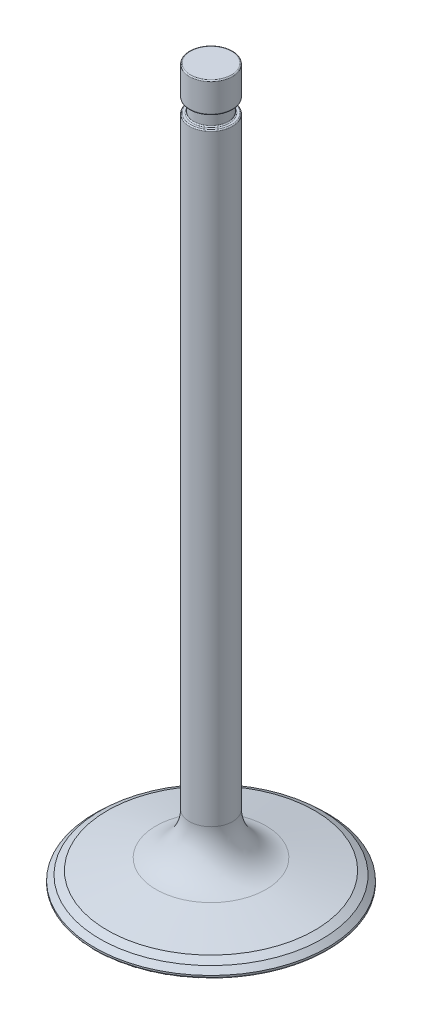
ISO-10303-21;
HEADER;
FILE_DESCRIPTION(('STEP AP214'),'2;1');
FILE_NAME('part.step','',(''),(''),'','','');
FILE_SCHEMA(('AUTOMOTIVE_DESIGN { 1 0 10303 214 1 1 1 1 }'));
ENDSEC;
DATA;
#1=APPLICATION_CONTEXT('core data for automotive mechanical design processes');
#2=APPLICATION_PROTOCOL_DEFINITION('international standard','automotive_design',2000,#1);
#3=PRODUCT_CONTEXT('',#1,'mechanical');
#4=PRODUCT('Part','Part','',(#3));
#5=PRODUCT_RELATED_PRODUCT_CATEGORY('part','',(#4));
#6=PRODUCT_DEFINITION_FORMATION('','',#4);
#7=PRODUCT_DEFINITION_CONTEXT('part definition',#1,'design');
#8=PRODUCT_DEFINITION('design','',#6,#7);
#9=PRODUCT_DEFINITION_SHAPE('','',#8);
#10=(LENGTH_UNIT() NAMED_UNIT(*) SI_UNIT(.MILLI.,.METRE.));
#11=(NAMED_UNIT(*) PLANE_ANGLE_UNIT() SI_UNIT($,.RADIAN.));
#12=(NAMED_UNIT(*) SI_UNIT($,.STERADIAN.) SOLID_ANGLE_UNIT());
#13=UNCERTAINTY_MEASURE_WITH_UNIT(LENGTH_MEASURE(1.E-05),#10,'distance_accuracy_value','');
#14=(GEOMETRIC_REPRESENTATION_CONTEXT(3) GLOBAL_UNCERTAINTY_ASSIGNED_CONTEXT((#13)) GLOBAL_UNIT_ASSIGNED_CONTEXT((#10,
#11,#12)) REPRESENTATION_CONTEXT('',''));
#15=CARTESIAN_POINT('',(0.,0.,0.));
#16=DIRECTION('',(0.,0.,1.));
#17=DIRECTION('',(1.,0.,0.));
#18=AXIS2_PLACEMENT_3D('',#15,#16,#17);
#19=CARTESIAN_POINT('',(0.,0.,0.));
#20=DIRECTION('',(0.,1.,0.));
#21=DIRECTION('',(0.,0.,1.));
#22=AXIS2_PLACEMENT_3D('',#19,#20,#21);
#23=PLANE('',#22);
#24=CARTESIAN_POINT('',(0.,0.,0.));
#25=DIRECTION('',(0.,1.,0.));
#26=DIRECTION('',(0.,0.,1.));
#27=AXIS2_PLACEMENT_3D('',#24,#25,#26);
#28=CIRCLE('',#27,26.75);
#29=CARTESIAN_POINT('',(0.,0.,26.75));
#30=VERTEX_POINT('',#29);
#31=EDGE_CURVE('E44',#30,#30,#28,.F.);
#32=ORIENTED_EDGE('',*,*,#31,.T.);
#33=EDGE_LOOP('',(#32));
#34=FACE_BOUND('',#33,.T.);
#35=ADVANCED_FACE('F33',(#34),#23,.F.);
#36=CARTESIAN_POINT('',(0.,0.,0.));
#37=DIRECTION('',(0.,-1.,0.));
#38=DIRECTION('',(0.,0.,-1.));
#39=AXIS2_PLACEMENT_3D('',#36,#37,#38);
#40=CYLINDRICAL_SURFACE('',#39,27.);
#41=CARTESIAN_POINT('',(0.,0.249999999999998,0.));
#42=DIRECTION('',(0.,1.,0.));
#43=DIRECTION('',(0.,0.,1.));
#44=AXIS2_PLACEMENT_3D('',#41,#42,#43);
#45=CIRCLE('',#44,27.);
#46=CARTESIAN_POINT('',(0.,0.249999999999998,27.));
#47=VERTEX_POINT('',#46);
#48=EDGE_CURVE('E40',#47,#47,#45,.T.);
#49=ORIENTED_EDGE('',*,*,#48,.T.);
#50=EDGE_LOOP('',(#49));
#51=FACE_BOUND('',#50,.T.);
#52=CARTESIAN_POINT('',(0.,0.637006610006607,0.));
#53=DIRECTION('',(0.,-1.,0.));
#54=DIRECTION('',(0.,0.,-1.));
#55=AXIS2_PLACEMENT_3D('',#52,#53,#54);
#56=CIRCLE('',#55,27.);
#57=CARTESIAN_POINT('',(0.,0.637006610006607,-27.));
#58=VERTEX_POINT('',#57);
#59=EDGE_CURVE('E83',#58,#58,#56,.T.);
#60=ORIENTED_EDGE('',*,*,#59,.T.);
#61=EDGE_LOOP('',(#60));
#62=FACE_BOUND('',#61,.T.);
#63=ADVANCED_FACE('F114',(#51,#62),#40,.T.);
#64=CARTESIAN_POINT('',(0.,7.,0.));
#65=DIRECTION('',(0.,-1.,0.));
#66=DIRECTION('',(0.,0.,-1.));
#67=AXIS2_PLACEMENT_3D('',#64,#65,#66);
#68=CONICAL_SURFACE('',#67,5.,1.34731972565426);
#69=CARTESIAN_POINT('',(0.,2.6648633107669,0.));
#70=DIRECTION('',(0.,-1.,0.));
#71=DIRECTION('',(0.,0.,-1.));
#72=AXIS2_PLACEMENT_3D('',#69,#70,#71);
#73=CIRCLE('',#72,24.0746014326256);
#74=CARTESIAN_POINT('',(0.,2.6648633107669,-24.0746014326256));
#75=VERTEX_POINT('',#74);
#76=EDGE_CURVE('E80',#75,#75,#73,.F.);
#77=ORIENTED_EDGE('',*,*,#76,.T.);
#78=EDGE_LOOP('',(#77));
#79=FACE_BOUND('',#78,.T.);
#80=CARTESIAN_POINT('',(0.,5.23095705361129,0.));
#81=DIRECTION('',(0.,-1.,0.));
#82=DIRECTION('',(0.,0.,-1.));
#83=AXIS2_PLACEMENT_3D('',#80,#81,#82);
#84=CIRCLE('',#83,12.7837889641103);
#85=CARTESIAN_POINT('',(0.,5.23095705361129,-12.7837889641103));
#86=VERTEX_POINT('',#85);
#87=EDGE_CURVE('E89',#86,#86,#84,.T.);
#88=ORIENTED_EDGE('',*,*,#87,.T.);
#89=EDGE_LOOP('',(#88));
#90=FACE_BOUND('',#89,.T.);
#91=ADVANCED_FACE('F93',(#79,#90),#68,.T.);
#92=CARTESIAN_POINT('',(0.,0.,0.));
#93=DIRECTION('',(0.,-1.,0.));
#94=DIRECTION('',(0.,0.,-1.));
#95=AXIS2_PLACEMENT_3D('',#92,#93,#94);
#96=CYLINDRICAL_SURFACE('',#95,5.);
#97=CARTESIAN_POINT('',(0.,154.75,0.));
#98=DIRECTION('',(0.,-1.,0.));
#99=DIRECTION('',(0.,0.,-1.));
#100=AXIS2_PLACEMENT_3D('',#97,#98,#99);
#101=CIRCLE('',#100,5.);
#102=CARTESIAN_POINT('',(0.,154.75,-5.));
#103=VERTEX_POINT('',#102);
#104=EDGE_CURVE('E10',#103,#103,#101,.T.);
#105=ORIENTED_EDGE('',*,*,#104,.T.);
#106=EDGE_LOOP('',(#105));
#107=FACE_BOUND('',#106,.T.);
#108=CARTESIAN_POINT('',(0.,14.9822856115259,0.));
#109=DIRECTION('',(0.,-1.,0.));
#110=DIRECTION('',(0.,0.,-1.));
#111=AXIS2_PLACEMENT_3D('',#108,#109,#110);
#112=CIRCLE('',#111,5.);
#113=CARTESIAN_POINT('',(0.,14.9822856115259,-5.));
#114=VERTEX_POINT('',#113);
#115=EDGE_CURVE('E86',#114,#114,#112,.F.);
#116=ORIENTED_EDGE('',*,*,#115,.T.);
#117=EDGE_LOOP('',(#116));
#118=FACE_BOUND('',#117,.T.);
#119=ADVANCED_FACE('F123',(#107,#118),#96,.T.);
#120=CARTESIAN_POINT('',(-4.,155.,0.));
#121=DIRECTION('',(0.,-1.,0.));
#122=DIRECTION('',(0.,0.,-1.));
#123=AXIS2_PLACEMENT_3D('',#120,#121,#122);
#124=PLANE('',#123);
#125=CARTESIAN_POINT('',(0.,155.,0.));
#126=DIRECTION('',(0.,-1.,0.));
#127=DIRECTION('',(0.,0.,-1.));
#128=AXIS2_PLACEMENT_3D('',#125,#126,#127);
#129=CIRCLE('',#128,4.25);
#130=CARTESIAN_POINT('',(0.,155.,-4.25));
#131=VERTEX_POINT('',#130);
#132=EDGE_CURVE('E59',#131,#131,#129,.T.);
#133=ORIENTED_EDGE('',*,*,#132,.T.);
#134=EDGE_LOOP('',(#133));
#135=FACE_BOUND('',#134,.T.);
#136=CARTESIAN_POINT('',(0.,155.,0.));
#137=DIRECTION('',(0.,-1.,0.));
#138=DIRECTION('',(0.,0.,-1.));
#139=AXIS2_PLACEMENT_3D('',#136,#137,#138);
#140=CIRCLE('',#139,4.75);
#141=CARTESIAN_POINT('',(0.,155.,-4.75));
#142=VERTEX_POINT('',#141);
#143=EDGE_CURVE('E62',#142,#142,#140,.F.);
#144=ORIENTED_EDGE('',*,*,#143,.T.);
#145=EDGE_LOOP('',(#144));
#146=FACE_BOUND('',#145,.T.);
#147=ADVANCED_FACE('F127',(#135,#146),#124,.F.);
#148=CARTESIAN_POINT('',(0.,0.,0.));
#149=DIRECTION('',(0.,-1.,0.));
#150=DIRECTION('',(0.,0.,-1.));
#151=AXIS2_PLACEMENT_3D('',#148,#149,#150);
#152=CYLINDRICAL_SURFACE('',#151,4.);
#153=CARTESIAN_POINT('',(0.,157.75,0.));
#154=DIRECTION('',(0.,1.,0.));
#155=DIRECTION('',(0.,0.,1.));
#156=AXIS2_PLACEMENT_3D('',#153,#154,#155);
#157=CIRCLE('',#156,4.);
#158=CARTESIAN_POINT('',(0.,157.75,4.));
#159=VERTEX_POINT('',#158);
#160=EDGE_CURVE('E71',#159,#159,#157,.F.);
#161=ORIENTED_EDGE('',*,*,#160,.T.);
#162=EDGE_LOOP('',(#161));
#163=FACE_BOUND('',#162,.T.);
#164=CARTESIAN_POINT('',(0.,155.25,0.));
#165=DIRECTION('',(0.,-1.,0.));
#166=DIRECTION('',(0.,0.,-1.));
#167=AXIS2_PLACEMENT_3D('',#164,#165,#166);
#168=CIRCLE('',#167,4.);
#169=CARTESIAN_POINT('',(0.,155.25,-4.));
#170=VERTEX_POINT('',#169);
#171=EDGE_CURVE('E74',#170,#170,#168,.F.);
#172=ORIENTED_EDGE('',*,*,#171,.T.);
#173=EDGE_LOOP('',(#172));
#174=FACE_BOUND('',#173,.T.);
#175=ADVANCED_FACE('F130',(#163,#174),#152,.T.);
#176=CARTESIAN_POINT('',(-5.,158.,0.));
#177=DIRECTION('',(0.,1.,0.));
#178=DIRECTION('',(0.,0.,1.));
#179=AXIS2_PLACEMENT_3D('',#176,#177,#178);
#180=PLANE('',#179);
#181=CARTESIAN_POINT('',(0.,158.,0.));
#182=DIRECTION('',(0.,1.,0.));
#183=DIRECTION('',(0.,0.,1.));
#184=AXIS2_PLACEMENT_3D('',#181,#182,#183);
#185=CIRCLE('',#184,4.25);
#186=CARTESIAN_POINT('',(0.,158.,4.25));
#187=VERTEX_POINT('',#186);
#188=EDGE_CURVE('E65',#187,#187,#185,.T.);
#189=ORIENTED_EDGE('',*,*,#188,.T.);
#190=EDGE_LOOP('',(#189));
#191=FACE_BOUND('',#190,.T.);
#192=CARTESIAN_POINT('',(0.,158.,0.));
#193=DIRECTION('',(0.,1.,0.));
#194=DIRECTION('',(0.,0.,1.));
#195=AXIS2_PLACEMENT_3D('',#192,#193,#194);
#196=CIRCLE('',#195,4.75);
#197=CARTESIAN_POINT('',(0.,158.,4.75));
#198=VERTEX_POINT('',#197);
#199=EDGE_CURVE('E68',#198,#198,#196,.F.);
#200=ORIENTED_EDGE('',*,*,#199,.T.);
#201=EDGE_LOOP('',(#200));
#202=FACE_BOUND('',#201,.T.);
#203=ADVANCED_FACE('F134',(#191,#202),#180,.F.);
#204=CARTESIAN_POINT('',(0.,0.,0.));
#205=DIRECTION('',(0.,-1.,0.));
#206=DIRECTION('',(0.,0.,-1.));
#207=AXIS2_PLACEMENT_3D('',#204,#205,#206);
#208=CYLINDRICAL_SURFACE('',#207,5.);
#209=CARTESIAN_POINT('',(0.,164.75,0.));
#210=DIRECTION('',(0.,-1.,0.));
#211=DIRECTION('',(0.,0.,-1.));
#212=AXIS2_PLACEMENT_3D('',#209,#210,#211);
#213=CIRCLE('',#212,5.);
#214=CARTESIAN_POINT('',(0.,164.75,-5.));
#215=VERTEX_POINT('',#214);
#216=EDGE_CURVE('E53',#215,#215,#213,.T.);
#217=ORIENTED_EDGE('',*,*,#216,.T.);
#218=EDGE_LOOP('',(#217));
#219=FACE_BOUND('',#218,.T.);
#220=CARTESIAN_POINT('',(0.,158.25,0.));
#221=DIRECTION('',(0.,1.,0.));
#222=DIRECTION('',(0.,0.,1.));
#223=AXIS2_PLACEMENT_3D('',#220,#221,#222);
#224=CIRCLE('',#223,5.);
#225=CARTESIAN_POINT('',(0.,158.25,5.));
#226=VERTEX_POINT('',#225);
#227=EDGE_CURVE('E56',#226,#226,#224,.T.);
#228=ORIENTED_EDGE('',*,*,#227,.T.);
#229=EDGE_LOOP('',(#228));
#230=FACE_BOUND('',#229,.T.);
#231=ADVANCED_FACE('F108',(#219,#230),#208,.T.);
#232=CARTESIAN_POINT('',(-5.,165.,0.));
#233=DIRECTION('',(0.,-1.,0.));
#234=DIRECTION('',(0.,0.,-1.));
#235=AXIS2_PLACEMENT_3D('',#232,#233,#234);
#236=PLANE('',#235);
#237=CARTESIAN_POINT('',(0.,165.,0.));
#238=DIRECTION('',(0.,-1.,0.));
#239=DIRECTION('',(0.,0.,-1.));
#240=AXIS2_PLACEMENT_3D('',#237,#238,#239);
#241=CIRCLE('',#240,4.75);
#242=CARTESIAN_POINT('',(0.,165.,-4.75));
#243=VERTEX_POINT('',#242);
#244=EDGE_CURVE('E48',#243,#243,#241,.F.);
#245=ORIENTED_EDGE('',*,*,#244,.T.);
#246=EDGE_LOOP('',(#245));
#247=FACE_BOUND('',#246,.T.);
#248=ADVANCED_FACE('F98',(#247),#236,.F.);
#249=CARTESIAN_POINT('',(0.,14.9822856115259,0.));
#250=DIRECTION('',(0.,-1.,0.));
#251=DIRECTION('',(0.,0.,-1.));
#252=AXIS2_PLACEMENT_3D('',#249,#250,#251);
#253=TOROIDAL_SURFACE('',#252,15.,10.);
#254=ORIENTED_EDGE('',*,*,#115,.F.);
#255=EDGE_LOOP('',(#254));
#256=FACE_BOUND('',#255,.T.);
#257=ORIENTED_EDGE('',*,*,#87,.F.);
#258=EDGE_LOOP('',(#257));
#259=FACE_BOUND('',#258,.T.);
#260=ADVANCED_FACE('F95',(#256,#259),#253,.F.);
#261=CARTESIAN_POINT('',(0.,0.637006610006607,0.));
#262=DIRECTION('',(0.,-1.,0.));
#263=DIRECTION('',(0.,0.,-1.));
#264=AXIS2_PLACEMENT_3D('',#261,#262,#263);
#265=CONICAL_SURFACE('',#264,27.,0.823720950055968);
#266=CARTESIAN_POINT('',(0.,1.76374627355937,0.));
#267=DIRECTION('',(0.,-1.,0.));
#268=DIRECTION('',(0.,0.,-1.));
#269=AXIS2_PLACEMENT_3D('',#266,#267,#268);
#270=CIRCLE('',#269,25.7834135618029);
#271=CARTESIAN_POINT('',(0.,1.76374627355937,-25.7834135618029));
#272=VERTEX_POINT('',#271);
#273=EDGE_CURVE('E77',#272,#272,#270,.T.);
#274=ORIENTED_EDGE('',*,*,#273,.T.);
#275=EDGE_LOOP('',(#274));
#276=FACE_BOUND('',#275,.T.);
#277=ORIENTED_EDGE('',*,*,#59,.F.);
#278=EDGE_LOOP('',(#277));
#279=FACE_BOUND('',#278,.T.);
#280=ADVANCED_FACE('F97',(#276,#279),#265,.T.);
#281=CARTESIAN_POINT('',(0.,2.66486331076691,0.));
#282=DIRECTION('',(0.,-1.,0.));
#283=DIRECTION('',(0.,0.,-1.));
#284=AXIS2_PLACEMENT_3D('',#281,#282,#283);
#285=CONICAL_SURFACE('',#284,24.0746014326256,1.08552033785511);
#286=CARTESIAN_POINT('',(0.,1.76374627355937,-25.7834135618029));
#287=CARTESIAN_POINT('',(0.,1.77313290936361,-25.7656134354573));
#288=CARTESIAN_POINT('',(0.,1.78251954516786,-25.7478133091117));
#289=CARTESIAN_POINT('',(0.,1.80129281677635,-25.7122130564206));
#290=CARTESIAN_POINT('',(0.,1.81067945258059,-25.694412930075));
#291=CARTESIAN_POINT('',(0.,1.82945272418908,-25.6588126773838));
#292=CARTESIAN_POINT('',(0.,1.83883935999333,-25.6410125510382));
#293=CARTESIAN_POINT('',(0.,1.85761263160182,-25.605412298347));
#294=CARTESIAN_POINT('',(0.,1.86699926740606,-25.5876121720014));
#295=CARTESIAN_POINT('',(0.,1.88577253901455,-25.5520119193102));
#296=CARTESIAN_POINT('',(0.,1.8951591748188,-25.5342117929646));
#297=CARTESIAN_POINT('',(0.,1.91393244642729,-25.4986115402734));
#298=CARTESIAN_POINT('',(0.,1.92331908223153,-25.4808114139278));
#299=CARTESIAN_POINT('',(0.,1.94209235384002,-25.4452111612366));
#300=CARTESIAN_POINT('',(0.,1.95147898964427,-25.427411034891));
#301=CARTESIAN_POINT('',(0.,1.97025226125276,-25.3918107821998));
#302=CARTESIAN_POINT('',(0.,1.97963889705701,-25.3740106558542));
#303=CARTESIAN_POINT('',(0.,1.9984121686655,-25.338410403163));
#304=CARTESIAN_POINT('',(0.,2.00779880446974,-25.3206102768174));
#305=CARTESIAN_POINT('',(0.,2.02657207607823,-25.2850100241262));
#306=CARTESIAN_POINT('',(0.,2.03595871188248,-25.2672098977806));
#307=CARTESIAN_POINT('',(0.,2.05473198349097,-25.2316096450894));
#308=CARTESIAN_POINT('',(0.,2.06411861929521,-25.2138095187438));
#309=CARTESIAN_POINT('',(0.,2.0828918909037,-25.1782092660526));
#310=CARTESIAN_POINT('',(0.,2.09227852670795,-25.160409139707));
#311=CARTESIAN_POINT('',(0.,2.11105179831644,-25.1248088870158));
#312=CARTESIAN_POINT('',(0.,2.12043843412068,-25.1070087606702));
#313=CARTESIAN_POINT('',(0.,2.13921170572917,-25.071408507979));
#314=CARTESIAN_POINT('',(0.,2.14859834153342,-25.0536083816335));
#315=CARTESIAN_POINT('',(0.,2.16737161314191,-25.0180081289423));
#316=CARTESIAN_POINT('',(0.,2.17675824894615,-25.0002080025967));
#317=CARTESIAN_POINT('',(0.,2.19553152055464,-24.9646077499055));
#318=CARTESIAN_POINT('',(0.,2.20491815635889,-24.9468076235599));
#319=CARTESIAN_POINT('',(0.,2.22369142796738,-24.9112073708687));
#320=CARTESIAN_POINT('',(0.,2.23307806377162,-24.8934072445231));
#321=CARTESIAN_POINT('',(0.,2.25185133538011,-24.8578069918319));
#322=CARTESIAN_POINT('',(0.,2.26123797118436,-24.8400068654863));
#323=CARTESIAN_POINT('',(0.,2.28001124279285,-24.8044066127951));
#324=CARTESIAN_POINT('',(0.,2.2893978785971,-24.7866064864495));
#325=CARTESIAN_POINT('',(0.,2.30817115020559,-24.7510062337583));
#326=CARTESIAN_POINT('',(0.,2.31755778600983,-24.7332061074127));
#327=CARTESIAN_POINT('',(0.,2.33633105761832,-24.6976058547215));
#328=CARTESIAN_POINT('',(0.,2.34571769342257,-24.6798057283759));
#329=CARTESIAN_POINT('',(0.,2.36449096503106,-24.6442054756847));
#330=CARTESIAN_POINT('',(0.,2.3738776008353,-24.6264053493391));
#331=CARTESIAN_POINT('',(0.,2.39265087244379,-24.5908050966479));
#332=CARTESIAN_POINT('',(0.,2.40203750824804,-24.5730049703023));
#333=CARTESIAN_POINT('',(0.,2.42081077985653,-24.5374047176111));
#334=CARTESIAN_POINT('',(0.,2.43019741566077,-24.5196045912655));
#335=CARTESIAN_POINT('',(0.,2.44897068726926,-24.4840043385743));
#336=CARTESIAN_POINT('',(0.,2.45835732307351,-24.4662042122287));
#337=CARTESIAN_POINT('',(0.,2.477130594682,-24.4306039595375));
#338=CARTESIAN_POINT('',(0.,2.48651723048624,-24.412803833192));
#339=CARTESIAN_POINT('',(0.,2.50529050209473,-24.3772035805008));
#340=CARTESIAN_POINT('',(0.,2.51467713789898,-24.3594034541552));
#341=CARTESIAN_POINT('',(0.,2.53345040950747,-24.323803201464));
#342=CARTESIAN_POINT('',(0.,2.54283704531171,-24.3060030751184));
#343=CARTESIAN_POINT('',(0.,2.56161031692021,-24.2704028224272));
#344=CARTESIAN_POINT('',(0.,2.57099695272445,-24.2526026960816));
#345=CARTESIAN_POINT('',(0.,2.58977022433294,-24.2170024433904));
#346=CARTESIAN_POINT('',(0.,2.59915686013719,-24.1992023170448));
#347=CARTESIAN_POINT('',(0.,2.61793013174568,-24.1636020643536));
#348=CARTESIAN_POINT('',(0.,2.62731676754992,-24.145801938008));
#349=CARTESIAN_POINT('',(0.,2.64609003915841,-24.1102016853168));
#350=CARTESIAN_POINT('',(0.,2.65547667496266,-24.0924015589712));
#351=CARTESIAN_POINT('',(0.,2.6648633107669,-24.0746014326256));
#352=B_SPLINE_CURVE_WITH_KNOTS('',3,(#286,#287,#288,#289,#290,#291,#292,#293,#294,#295,#296,
#297,#298,#299,#300,#301,#302,#303,#304,#305,#306,#307,#308,#309,#310,#311,#312,#313,#314,#315,
#316,#317,#318,#319,#320,#321,#322,#323,#324,#325,#326,#327,#328,#329,#330,#331,#332,#333,#334,
#335,#336,#337,#338,#339,#340,#341,#342,#343,#344,#345,#346,#347,#348,#349,#350,#351),
.UNSPECIFIED.,.F.,.F.,(4,2,2,2,2,2,2,2,2,2,2,2,2,2,2,2,2,2,2,2,2,2,2,2,2,2,2,2,2,2,2,2,4),(0.,
0.0603703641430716,0.12074072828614,0.181111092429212,0.24148145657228,0.301851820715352,
0.36222218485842,0.422592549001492,0.48296291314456,0.543333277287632,0.6037036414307,
0.664074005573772,0.72444436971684,0.784814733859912,0.845185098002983,0.905555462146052,
0.965925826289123,1.02629619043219,1.08666655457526,1.14703691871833,1.2074072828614,
1.26777764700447,1.32814801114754,1.38851837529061,1.44888873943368,1.50925910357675,
1.56962946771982,1.62999983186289,1.69037019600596,1.75074056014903,1.8111109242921,
1.87148128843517,1.93185165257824),.UNSPECIFIED.);
#353=EDGE_CURVE('BSEAM105',#272,#75,#352,.T.);
#354=ORIENTED_EDGE('',*,*,#273,.F.);
#355=ORIENTED_EDGE('',*,*,#76,.F.);
#356=ORIENTED_EDGE('',*,*,#353,.T.);
#357=ORIENTED_EDGE('',*,*,#353,.F.);
#358=EDGE_LOOP('',(#354,#356,#355,#357));
#359=FACE_BOUND('',#358,.T.);
#360=ADVANCED_FACE('F105',(#359),#285,.T.);
#361=CARTESIAN_POINT('',(0.,157.75,0.));
#362=DIRECTION('',(0.,1.,0.));
#363=DIRECTION('',(0.,0.,1.));
#364=AXIS2_PLACEMENT_3D('',#361,#362,#363);
#365=TOROIDAL_SURFACE('',#364,4.25,0.25);
#366=ORIENTED_EDGE('',*,*,#188,.F.);
#367=EDGE_LOOP('',(#366));
#368=FACE_BOUND('',#367,.T.);
#369=ORIENTED_EDGE('',*,*,#160,.F.);
#370=EDGE_LOOP('',(#369));
#371=FACE_BOUND('',#370,.T.);
#372=ADVANCED_FACE('F166',(#368,#371),#365,.F.);
#373=CARTESIAN_POINT('',(0.,155.25,0.));
#374=DIRECTION('',(0.,-1.,0.));
#375=DIRECTION('',(0.,0.,-1.));
#376=AXIS2_PLACEMENT_3D('',#373,#374,#375);
#377=TOROIDAL_SURFACE('',#376,4.25,0.25);
#378=ORIENTED_EDGE('',*,*,#171,.F.);
#379=EDGE_LOOP('',(#378));
#380=FACE_BOUND('',#379,.T.);
#381=ORIENTED_EDGE('',*,*,#132,.F.);
#382=EDGE_LOOP('',(#381));
#383=FACE_BOUND('',#382,.T.);
#384=ADVANCED_FACE('F160',(#380,#383),#377,.F.);
#385=CARTESIAN_POINT('',(0.,164.75,0.));
#386=DIRECTION('',(0.,-1.,0.));
#387=DIRECTION('',(0.,0.,-1.));
#388=AXIS2_PLACEMENT_3D('',#385,#386,#387);
#389=TOROIDAL_SURFACE('',#388,4.75,0.25);
#390=ORIENTED_EDGE('',*,*,#244,.F.);
#391=EDGE_LOOP('',(#390));
#392=FACE_BOUND('',#391,.T.);
#393=ORIENTED_EDGE('',*,*,#216,.F.);
#394=EDGE_LOOP('',(#393));
#395=FACE_BOUND('',#394,.T.);
#396=ADVANCED_FACE('F151',(#392,#395),#389,.T.);
#397=CARTESIAN_POINT('',(0.,158.25,0.));
#398=DIRECTION('',(0.,1.,0.));
#399=DIRECTION('',(0.,0.,1.));
#400=AXIS2_PLACEMENT_3D('',#397,#398,#399);
#401=TOROIDAL_SURFACE('',#400,4.75,0.25);
#402=ORIENTED_EDGE('',*,*,#227,.F.);
#403=EDGE_LOOP('',(#402));
#404=FACE_BOUND('',#403,.T.);
#405=ORIENTED_EDGE('',*,*,#199,.F.);
#406=EDGE_LOOP('',(#405));
#407=FACE_BOUND('',#406,.T.);
#408=ADVANCED_FACE('F147',(#404,#407),#401,.T.);
#409=CARTESIAN_POINT('',(0.,0.249999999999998,0.));
#410=DIRECTION('',(0.,1.,0.));
#411=DIRECTION('',(0.,0.,1.));
#412=AXIS2_PLACEMENT_3D('',#409,#410,#411);
#413=TOROIDAL_SURFACE('',#412,26.75,0.25);
#414=ORIENTED_EDGE('',*,*,#48,.F.);
#415=EDGE_LOOP('',(#414));
#416=FACE_BOUND('',#415,.T.);
#417=ORIENTED_EDGE('',*,*,#31,.F.);
#418=EDGE_LOOP('',(#417));
#419=FACE_BOUND('',#418,.T.);
#420=ADVANCED_FACE('F150',(#416,#419),#413,.T.);
#421=CARTESIAN_POINT('',(0.,154.75,0.));
#422=DIRECTION('',(0.,-1.,0.));
#423=DIRECTION('',(0.,0.,-1.));
#424=AXIS2_PLACEMENT_3D('',#421,#422,#423);
#425=TOROIDAL_SURFACE('',#424,4.75,0.25);
#426=ORIENTED_EDGE('',*,*,#143,.F.);
#427=EDGE_LOOP('',(#426));
#428=FACE_BOUND('',#427,.T.);
#429=ORIENTED_EDGE('',*,*,#104,.F.);
#430=EDGE_LOOP('',(#429));
#431=FACE_BOUND('',#430,.T.);
#432=ADVANCED_FACE('F35',(#428,#431),#425,.T.);
#433=CLOSED_SHELL('',(#35,#63,#91,#119,#147,#175,#203,#231,#248,#260,#280,#360,#372,#384,#396,
#408,#420,#432));
#434=MANIFOLD_SOLID_BREP('B2',#433);
#435=ADVANCED_BREP_SHAPE_REPRESENTATION('',(#18,#434),#14);
#436=SHAPE_DEFINITION_REPRESENTATION(#9,#435);
ENDSEC;
END-ISO-10303-21;
